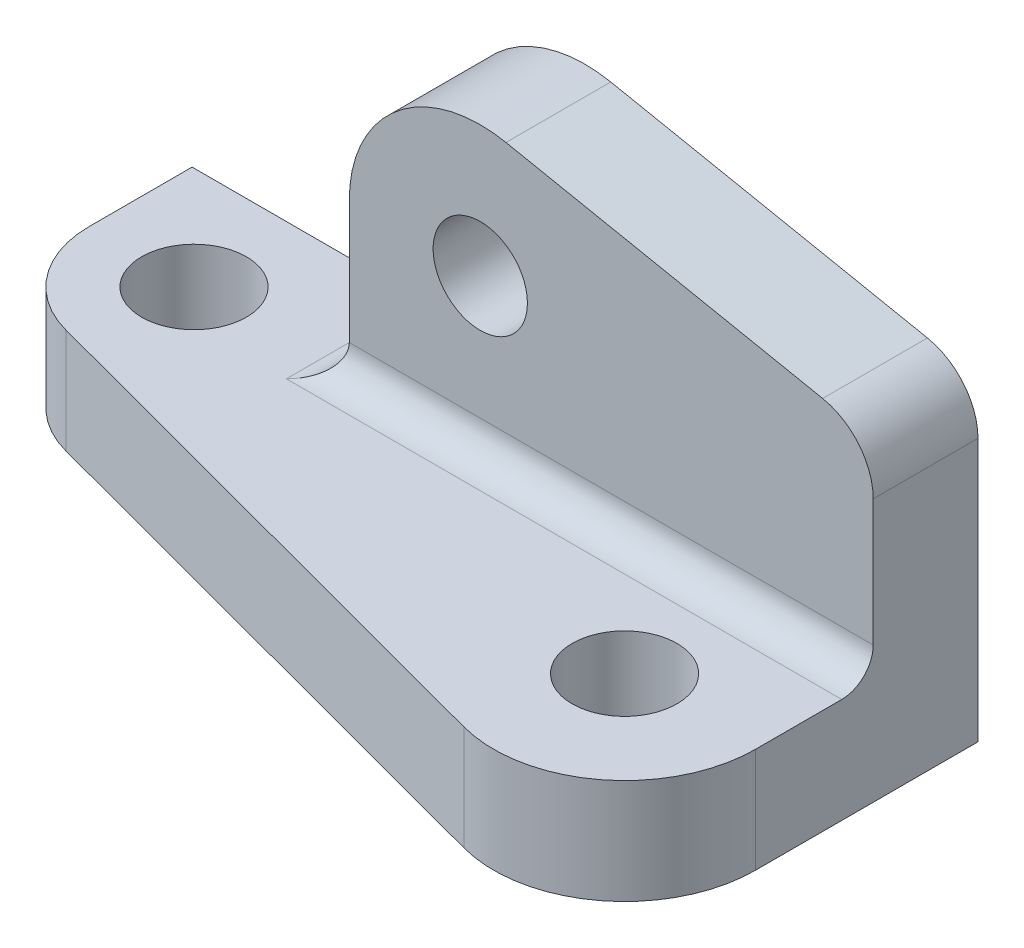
ISO-10303-21;
HEADER;
FILE_DESCRIPTION(('STEP AP214'),'2;1');
FILE_NAME('part.step','',(''),(''),'','','');
FILE_SCHEMA(('AUTOMOTIVE_DESIGN { 1 0 10303 214 1 1 1 1 }'));
ENDSEC;
DATA;
#1=APPLICATION_CONTEXT('core data for automotive mechanical design processes');
#2=APPLICATION_PROTOCOL_DEFINITION('international standard','automotive_design',2000,#1);
#3=PRODUCT_CONTEXT('',#1,'mechanical');
#4=PRODUCT('Part','Part','',(#3));
#5=PRODUCT_RELATED_PRODUCT_CATEGORY('part','',(#4));
#6=PRODUCT_DEFINITION_FORMATION('','',#4);
#7=PRODUCT_DEFINITION_CONTEXT('part definition',#1,'design');
#8=PRODUCT_DEFINITION('design','',#6,#7);
#9=PRODUCT_DEFINITION_SHAPE('','',#8);
#10=(LENGTH_UNIT() NAMED_UNIT(*) SI_UNIT(.MILLI.,.METRE.));
#11=(NAMED_UNIT(*) PLANE_ANGLE_UNIT() SI_UNIT($,.RADIAN.));
#12=(NAMED_UNIT(*) SI_UNIT($,.STERADIAN.) SOLID_ANGLE_UNIT());
#13=UNCERTAINTY_MEASURE_WITH_UNIT(LENGTH_MEASURE(1.E-05),#10,'distance_accuracy_value','');
#14=(GEOMETRIC_REPRESENTATION_CONTEXT(3) GLOBAL_UNCERTAINTY_ASSIGNED_CONTEXT((#13)) GLOBAL_UNIT_ASSIGNED_CONTEXT((#10,
#11,#12)) REPRESENTATION_CONTEXT('',''));
#15=CARTESIAN_POINT('',(0.,0.,0.));
#16=DIRECTION('',(0.,0.,1.));
#17=DIRECTION('',(1.,0.,0.));
#18=AXIS2_PLACEMENT_3D('',#15,#16,#17);
#19=CARTESIAN_POINT('',(0.,20.,0.));
#20=DIRECTION('',(1.,0.,0.));
#21=DIRECTION('',(0.,0.,-1.));
#22=AXIS2_PLACEMENT_3D('',#19,#20,#21);
#23=PLANE('',#22);
#24=DIRECTION('',(0.,0.,1.));
#25=VECTOR('',#24,1.);
#26=CARTESIAN_POINT('',(0.,0.,0.));
#27=LINE('',#26,#25);
#28=CARTESIAN_POINT('',(0.,0.,0.));
#29=VERTEX_POINT('',#28);
#30=CARTESIAN_POINT('',(0.,0.,19.63443373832));
#31=VERTEX_POINT('',#30);
#32=EDGE_CURVE('E149',#29,#31,#27,.T.);
#33=ORIENTED_EDGE('',*,*,#32,.T.);
#34=DIRECTION('',(0.,-1.,0.));
#35=VECTOR('',#34,1.);
#36=CARTESIAN_POINT('',(0.,20.,19.63443373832));
#37=LINE('',#36,#35);
#38=CARTESIAN_POINT('',(0.,20.,19.63443373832));
#39=VERTEX_POINT('',#38);
#40=EDGE_CURVE('E185',#31,#39,#37,.F.);
#41=ORIENTED_EDGE('',*,*,#40,.T.);
#42=DIRECTION('',(0.,0.,1.));
#43=VECTOR('',#42,1.);
#44=CARTESIAN_POINT('',(0.,20.,0.));
#45=LINE('',#44,#43);
#46=CARTESIAN_POINT('',(0.,20.,0.));
#47=VERTEX_POINT('',#46);
#48=EDGE_CURVE('E150',#47,#39,#45,.T.);
#49=ORIENTED_EDGE('',*,*,#48,.F.);
#50=DIRECTION('',(0.,-1.,0.));
#51=VECTOR('',#50,1.);
#52=CARTESIAN_POINT('',(0.,20.,0.));
#53=LINE('',#52,#51);
#54=EDGE_CURVE('E132',#47,#29,#53,.T.);
#55=ORIENTED_EDGE('',*,*,#54,.T.);
#56=EDGE_LOOP('',(#33,#41,#49,#55));
#57=FACE_BOUND('',#56,.T.);
#58=ADVANCED_FACE('F28',(#57),#23,.F.);
#59=CARTESIAN_POINT('',(0.,20.,35.));
#60=DIRECTION('',(0.257662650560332,0.,-0.966234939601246));
#61=DIRECTION('',(-0.966234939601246,0.,-0.257662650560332));
#62=AXIS2_PLACEMENT_3D('',#59,#60,#61);
#63=PLANE('',#62);
#64=DIRECTION('',(0.966234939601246,0.,0.257662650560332));
#65=VECTOR('',#64,1.);
#66=CARTESIAN_POINT('',(0.,20.,35.));
#67=LINE('',#66,#65);
#68=CARTESIAN_POINT('',(14.8467469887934,20.,38.9591325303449));
#69=VERTEX_POINT('',#68);
#70=CARTESIAN_POINT('',(118.558433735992,20.,66.6155823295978));
#71=VERTEX_POINT('',#70);
#72=EDGE_CURVE('E153',#69,#71,#67,.T.);
#73=ORIENTED_EDGE('',*,*,#72,.F.);
#74=DIRECTION('',(0.,-1.,0.));
#75=VECTOR('',#74,1.);
#76=CARTESIAN_POINT('',(14.8467469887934,20.,38.9591325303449));
#77=LINE('',#76,#75);
#78=CARTESIAN_POINT('',(14.8467469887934,0.,38.9591325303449));
#79=VERTEX_POINT('',#78);
#80=EDGE_CURVE('E180',#69,#79,#77,.T.);
#81=ORIENTED_EDGE('',*,*,#80,.T.);
#82=DIRECTION('',(0.966234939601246,0.,0.257662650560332));
#83=VECTOR('',#82,1.);
#84=CARTESIAN_POINT('',(0.,0.,35.));
#85=LINE('',#84,#83);
#86=CARTESIAN_POINT('',(118.558433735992,0.,66.6155823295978));
#87=VERTEX_POINT('',#86);
#88=EDGE_CURVE('E143',#79,#87,#85,.T.);
#89=ORIENTED_EDGE('',*,*,#88,.T.);
#90=DIRECTION('',(0.,-1.,0.));
#91=VECTOR('',#90,1.);
#92=CARTESIAN_POINT('',(118.558433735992,20.,66.6155823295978));
#93=LINE('',#92,#91);
#94=EDGE_CURVE('E175',#87,#71,#93,.F.);
#95=ORIENTED_EDGE('',*,*,#94,.T.);
#96=EDGE_LOOP('',(#73,#81,#89,#95));
#97=FACE_BOUND('',#96,.T.);
#98=ADVANCED_FACE('F294',(#97),#63,.F.);
#99=CARTESIAN_POINT('',(150.,20.,0.));
#100=DIRECTION('',(-1.,0.,0.));
#101=DIRECTION('',(0.,0.,1.));
#102=AXIS2_PLACEMENT_3D('',#99,#100,#101);
#103=PLANE('',#102);
#104=DIRECTION('',(0.,-1.,0.));
#105=VECTOR('',#104,1.);
#106=CARTESIAN_POINT('',(150.,20.,0.));
#107=LINE('',#106,#105);
#108=CARTESIAN_POINT('',(150.,50.1623531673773,0.));
#109=VERTEX_POINT('',#108);
#110=CARTESIAN_POINT('',(150.,0.,0.));
#111=VERTEX_POINT('',#110);
#112=EDGE_CURVE('E120',#109,#111,#107,.T.);
#113=ORIENTED_EDGE('',*,*,#112,.F.);
#114=DIRECTION('',(0.,0.,-1.));
#115=VECTOR('',#114,1.);
#116=CARTESIAN_POINT('',(150.,50.1623531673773,20.));
#117=LINE('',#116,#115);
#118=CARTESIAN_POINT('',(150.,50.1623531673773,20.));
#119=VERTEX_POINT('',#118);
#120=EDGE_CURVE('E193',#109,#119,#117,.F.);
#121=ORIENTED_EDGE('',*,*,#120,.T.);
#122=DIRECTION('',(0.,-1.,0.));
#123=VECTOR('',#122,1.);
#124=CARTESIAN_POINT('',(150.,0.,20.));
#125=LINE('',#124,#123);
#126=CARTESIAN_POINT('',(150.,26.,20.));
#127=VERTEX_POINT('',#126);
#128=EDGE_CURVE('E223',#119,#127,#125,.T.);
#129=ORIENTED_EDGE('',*,*,#128,.T.);
#130=CARTESIAN_POINT('',(150.,26.,26.));
#131=DIRECTION('',(-1.,0.,0.));
#132=DIRECTION('',(0.,0.,1.));
#133=AXIS2_PLACEMENT_3D('',#130,#131,#132);
#134=CIRCLE('',#133,6.);
#135=CARTESIAN_POINT('',(150.,20.,26.));
#136=VERTEX_POINT('',#135);
#137=EDGE_CURVE('E11',#127,#136,#134,.T.);
#138=ORIENTED_EDGE('',*,*,#137,.T.);
#139=DIRECTION('',(0.,0.,-1.));
#140=VECTOR('',#139,1.);
#141=CARTESIAN_POINT('',(150.,20.,0.));
#142=LINE('',#141,#140);
#143=CARTESIAN_POINT('',(150.,20.,42.4597088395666));
#144=VERTEX_POINT('',#143);
#145=EDGE_CURVE('E158',#144,#136,#142,.T.);
#146=ORIENTED_EDGE('',*,*,#145,.F.);
#147=DIRECTION('',(0.,-1.,0.));
#148=VECTOR('',#147,1.);
#149=CARTESIAN_POINT('',(150.,20.,42.4597088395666));
#150=LINE('',#149,#148);
#151=CARTESIAN_POINT('',(150.,0.,42.4597088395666));
#152=VERTEX_POINT('',#151);
#153=EDGE_CURVE('E140',#144,#152,#150,.T.);
#154=ORIENTED_EDGE('',*,*,#153,.T.);
#155=DIRECTION('',(0.,0.,-1.));
#156=VECTOR('',#155,1.);
#157=CARTESIAN_POINT('',(150.,0.,0.));
#158=LINE('',#157,#156);
#159=EDGE_CURVE('E136',#152,#111,#158,.T.);
#160=ORIENTED_EDGE('',*,*,#159,.T.);
#161=EDGE_LOOP('',(#113,#121,#129,#138,#146,#154,#160));
#162=FACE_BOUND('',#161,.T.);
#163=ADVANCED_FACE('F137',(#162),#103,.F.);
#164=CARTESIAN_POINT('',(0.,20.,0.));
#165=DIRECTION('',(0.,0.,1.));
#166=DIRECTION('',(1.,0.,0.));
#167=AXIS2_PLACEMENT_3D('',#164,#165,#166);
#168=PLANE('',#167);
#169=CARTESIAN_POINT('',(75.,49.5049024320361,0.));
#170=DIRECTION('',(0.,0.,1.));
#171=DIRECTION('',(1.,0.,0.));
#172=AXIS2_PLACEMENT_3D('',#169,#170,#171);
#173=CIRCLE('',#172,8.99999999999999);
#174=CARTESIAN_POINT('',(84.,49.5049024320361,0.));
#175=VERTEX_POINT('',#174);
#176=EDGE_CURVE('E254',#175,#175,#173,.T.);
#177=ORIENTED_EDGE('',*,*,#176,.T.);
#178=EDGE_LOOP('',(#177));
#179=FACE_BOUND('',#178,.T.);
#180=DIRECTION('',(0.98058067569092,-0.196116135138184,0.));
#181=VECTOR('',#180,1.);
#182=CARTESIAN_POINT('',(150.,60.,0.));
#183=LINE('',#182,#181);
#184=CARTESIAN_POINT('',(79.9029033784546,74.0194193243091,0.));
#185=VERTEX_POINT('',#184);
#186=CARTESIAN_POINT('',(140.353393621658,61.9293212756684,0.));
#187=VERTEX_POINT('',#186);
#188=EDGE_CURVE('E213',#185,#187,#183,.T.);
#189=ORIENTED_EDGE('',*,*,#188,.T.);
#190=CARTESIAN_POINT('',(138.,50.1623531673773,0.));
#191=DIRECTION('',(0.,0.,1.));
#192=DIRECTION('',(1.,0.,0.));
#193=AXIS2_PLACEMENT_3D('',#190,#191,#192);
#194=CIRCLE('',#193,12.);
#195=EDGE_CURVE('E128',#187,#109,#194,.F.);
#196=ORIENTED_EDGE('',*,*,#195,.T.);
#197=ORIENTED_EDGE('',*,*,#112,.T.);
#198=DIRECTION('',(-1.,0.,0.));
#199=VECTOR('',#198,1.);
#200=CARTESIAN_POINT('',(0.,0.,0.));
#201=LINE('',#200,#199);
#202=EDGE_CURVE('E126',#111,#29,#201,.T.);
#203=ORIENTED_EDGE('',*,*,#202,.T.);
#204=ORIENTED_EDGE('',*,*,#54,.F.);
#205=DIRECTION('',(-1.,0.,0.));
#206=VECTOR('',#205,1.);
#207=CARTESIAN_POINT('',(0.,20.,0.));
#208=LINE('',#207,#206);
#209=CARTESIAN_POINT('',(44.,20.,0.));
#210=VERTEX_POINT('',#209);
#211=EDGE_CURVE('E160',#210,#47,#208,.T.);
#212=ORIENTED_EDGE('',*,*,#211,.F.);
#213=CARTESIAN_POINT('',(44.,26.,0.));
#214=DIRECTION('',(0.,0.,1.));
#215=DIRECTION('',(1.,0.,0.));
#216=AXIS2_PLACEMENT_3D('',#213,#214,#215);
#217=CIRCLE('',#216,6.);
#218=CARTESIAN_POINT('',(50.,26.,0.));
#219=VERTEX_POINT('',#218);
#220=EDGE_CURVE('E35',#210,#219,#217,.T.);
#221=ORIENTED_EDGE('',*,*,#220,.T.);
#222=DIRECTION('',(0.,1.,0.));
#223=VECTOR('',#222,1.);
#224=CARTESIAN_POINT('',(50.,0.,0.));
#225=LINE('',#224,#223);
#226=CARTESIAN_POINT('',(50.,49.5049024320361,0.));
#227=VERTEX_POINT('',#226);
#228=EDGE_CURVE('E206',#219,#227,#225,.T.);
#229=ORIENTED_EDGE('',*,*,#228,.T.);
#230=CARTESIAN_POINT('',(75.,49.5049024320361,0.));
#231=DIRECTION('',(0.,0.,1.));
#232=DIRECTION('',(1.,0.,0.));
#233=AXIS2_PLACEMENT_3D('',#230,#231,#232);
#234=CIRCLE('',#233,25.);
#235=EDGE_CURVE('E165',#227,#185,#234,.F.);
#236=ORIENTED_EDGE('',*,*,#235,.T.);
#237=EDGE_LOOP('',(#189,#196,#197,#203,#204,#212,#221,#229,#236));
#238=FACE_BOUND('',#237,.T.);
#239=ADVANCED_FACE('F123',(#179,#238),#168,.F.);
#240=CARTESIAN_POINT('',(0.,20.,0.));
#241=DIRECTION('',(0.,1.,0.));
#242=DIRECTION('',(0.,0.,1.));
#243=AXIS2_PLACEMENT_3D('',#240,#241,#242);
#244=PLANE('',#243);
#245=CARTESIAN_POINT('',(125.,20.,42.4597088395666));
#246=DIRECTION('',(0.,1.,0.));
#247=DIRECTION('',(0.,0.,1.));
#248=AXIS2_PLACEMENT_3D('',#245,#246,#247);
#249=CIRCLE('',#248,9.99999999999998);
#250=CARTESIAN_POINT('',(125.,20.,52.4597088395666));
#251=VERTEX_POINT('',#250);
#252=EDGE_CURVE('E248',#251,#251,#249,.T.);
#253=ORIENTED_EDGE('',*,*,#252,.F.);
#254=EDGE_LOOP('',(#253));
#255=FACE_BOUND('',#254,.T.);
#256=CARTESIAN_POINT('',(20.,20.,19.63443373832));
#257=DIRECTION('',(0.,1.,0.));
#258=DIRECTION('',(0.,0.,1.));
#259=AXIS2_PLACEMENT_3D('',#256,#257,#258);
#260=CIRCLE('',#259,9.99999999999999);
#261=CARTESIAN_POINT('',(20.,20.,29.63443373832));
#262=VERTEX_POINT('',#261);
#263=EDGE_CURVE('E242',#262,#262,#260,.T.);
#264=ORIENTED_EDGE('',*,*,#263,.F.);
#265=EDGE_LOOP('',(#264));
#266=FACE_BOUND('',#265,.T.);
#267=DIRECTION('',(1.,0.,0.));
#268=VECTOR('',#267,1.);
#269=CARTESIAN_POINT('',(50.,20.,26.));
#270=LINE('',#269,#268);
#271=CARTESIAN_POINT('',(44.,20.,26.));
#272=VERTEX_POINT('',#271);
#273=EDGE_CURVE('E50',#136,#272,#270,.F.);
#274=ORIENTED_EDGE('',*,*,#273,.T.);
#275=DIRECTION('',(0.,0.,1.));
#276=VECTOR('',#275,1.);
#277=CARTESIAN_POINT('',(44.,20.,0.));
#278=LINE('',#277,#276);
#279=EDGE_CURVE('E201',#272,#210,#278,.F.);
#280=ORIENTED_EDGE('',*,*,#279,.T.);
#281=ORIENTED_EDGE('',*,*,#211,.T.);
#282=ORIENTED_EDGE('',*,*,#48,.T.);
#283=CARTESIAN_POINT('',(20.,20.,19.63443373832));
#284=DIRECTION('',(0.,1.,0.));
#285=DIRECTION('',(0.,0.,1.));
#286=AXIS2_PLACEMENT_3D('',#283,#284,#285);
#287=CIRCLE('',#286,20.);
#288=EDGE_CURVE('E187',#39,#69,#287,.T.);
#289=ORIENTED_EDGE('',*,*,#288,.T.);
#290=ORIENTED_EDGE('',*,*,#72,.T.);
#291=CARTESIAN_POINT('',(125.,20.,42.4597088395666));
#292=DIRECTION('',(0.,1.,0.));
#293=DIRECTION('',(0.,0.,1.));
#294=AXIS2_PLACEMENT_3D('',#291,#292,#293);
#295=CIRCLE('',#294,25.);
#296=EDGE_CURVE('E178',#71,#144,#295,.T.);
#297=ORIENTED_EDGE('',*,*,#296,.T.);
#298=ORIENTED_EDGE('',*,*,#145,.T.);
#299=EDGE_LOOP('',(#274,#280,#281,#282,#289,#290,#297,#298));
#300=FACE_BOUND('',#299,.T.);
#301=ADVANCED_FACE('F224',(#255,#266,#300),#244,.T.);
#302=CARTESIAN_POINT('',(0.,0.,0.));
#303=DIRECTION('',(0.,1.,0.));
#304=DIRECTION('',(0.,0.,1.));
#305=AXIS2_PLACEMENT_3D('',#302,#303,#304);
#306=PLANE('',#305);
#307=CARTESIAN_POINT('',(125.,0.,42.4597088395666));
#308=DIRECTION('',(0.,1.,0.));
#309=DIRECTION('',(0.,0.,1.));
#310=AXIS2_PLACEMENT_3D('',#307,#308,#309);
#311=CIRCLE('',#310,10.);
#312=CARTESIAN_POINT('',(125.,0.,52.4597088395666));
#313=VERTEX_POINT('',#312);
#314=EDGE_CURVE('E245',#313,#313,#311,.T.);
#315=ORIENTED_EDGE('',*,*,#314,.T.);
#316=EDGE_LOOP('',(#315));
#317=FACE_BOUND('',#316,.T.);
#318=CARTESIAN_POINT('',(20.,0.,19.63443373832));
#319=DIRECTION('',(0.,1.,0.));
#320=DIRECTION('',(0.,0.,1.));
#321=AXIS2_PLACEMENT_3D('',#318,#319,#320);
#322=CIRCLE('',#321,9.99999999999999);
#323=CARTESIAN_POINT('',(20.,0.,29.63443373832));
#324=VERTEX_POINT('',#323);
#325=EDGE_CURVE('E219',#324,#324,#322,.T.);
#326=ORIENTED_EDGE('',*,*,#325,.T.);
#327=EDGE_LOOP('',(#326));
#328=FACE_BOUND('',#327,.T.);
#329=ORIENTED_EDGE('',*,*,#88,.F.);
#330=CARTESIAN_POINT('',(20.,0.,19.63443373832));
#331=DIRECTION('',(0.,1.,0.));
#332=DIRECTION('',(0.,0.,1.));
#333=AXIS2_PLACEMENT_3D('',#330,#331,#332);
#334=CIRCLE('',#333,20.);
#335=EDGE_CURVE('E183',#79,#31,#334,.F.);
#336=ORIENTED_EDGE('',*,*,#335,.T.);
#337=ORIENTED_EDGE('',*,*,#32,.F.);
#338=ORIENTED_EDGE('',*,*,#202,.F.);
#339=ORIENTED_EDGE('',*,*,#159,.F.);
#340=CARTESIAN_POINT('',(125.,0.,42.4597088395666));
#341=DIRECTION('',(0.,1.,0.));
#342=DIRECTION('',(0.,0.,1.));
#343=AXIS2_PLACEMENT_3D('',#340,#341,#342);
#344=CIRCLE('',#343,25.);
#345=EDGE_CURVE('E173',#152,#87,#344,.F.);
#346=ORIENTED_EDGE('',*,*,#345,.T.);
#347=EDGE_LOOP('',(#329,#336,#337,#338,#339,#346));
#348=FACE_BOUND('',#347,.T.);
#349=ADVANCED_FACE('F147',(#317,#328,#348),#306,.F.);
#350=CARTESIAN_POINT('',(150.,60.,20.));
#351=DIRECTION('',(0.196116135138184,0.98058067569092,0.));
#352=DIRECTION('',(-0.98058067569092,0.196116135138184,0.));
#353=AXIS2_PLACEMENT_3D('',#350,#351,#352);
#354=PLANE('',#353);
#355=DIRECTION('',(0.98058067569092,-0.196116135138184,0.));
#356=VECTOR('',#355,1.);
#357=CARTESIAN_POINT('',(150.,60.,20.));
#358=LINE('',#357,#356);
#359=CARTESIAN_POINT('',(79.9029033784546,74.0194193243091,20.));
#360=VERTEX_POINT('',#359);
#361=CARTESIAN_POINT('',(140.353393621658,61.9293212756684,20.));
#362=VERTEX_POINT('',#361);
#363=EDGE_CURVE('E231',#360,#362,#358,.T.);
#364=ORIENTED_EDGE('',*,*,#363,.T.);
#365=DIRECTION('',(0.,0.,-1.));
#366=VECTOR('',#365,1.);
#367=CARTESIAN_POINT('',(140.353393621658,61.9293212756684,0.));
#368=LINE('',#367,#366);
#369=EDGE_CURVE('E189',#362,#187,#368,.T.);
#370=ORIENTED_EDGE('',*,*,#369,.T.);
#371=ORIENTED_EDGE('',*,*,#188,.F.);
#372=DIRECTION('',(0.,0.,-1.));
#373=VECTOR('',#372,1.);
#374=CARTESIAN_POINT('',(79.9029033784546,74.0194193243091,20.));
#375=LINE('',#374,#373);
#376=EDGE_CURVE('E167',#185,#360,#375,.F.);
#377=ORIENTED_EDGE('',*,*,#376,.T.);
#378=EDGE_LOOP('',(#364,#370,#371,#377));
#379=FACE_BOUND('',#378,.T.);
#380=ADVANCED_FACE('F276',(#379),#354,.T.);
#381=CARTESIAN_POINT('',(50.,0.,20.));
#382=DIRECTION('',(-1.,0.,0.));
#383=DIRECTION('',(0.,0.,1.));
#384=AXIS2_PLACEMENT_3D('',#381,#382,#383);
#385=PLANE('',#384);
#386=ORIENTED_EDGE('',*,*,#228,.F.);
#387=DIRECTION('',(0.,0.,1.));
#388=VECTOR('',#387,1.);
#389=CARTESIAN_POINT('',(50.,26.,20.));
#390=LINE('',#389,#388);
#391=CARTESIAN_POINT('',(50.,26.,20.));
#392=VERTEX_POINT('',#391);
#393=EDGE_CURVE('E197',#219,#392,#390,.T.);
#394=ORIENTED_EDGE('',*,*,#393,.T.);
#395=DIRECTION('',(0.,1.,0.));
#396=VECTOR('',#395,1.);
#397=CARTESIAN_POINT('',(50.,0.,20.));
#398=LINE('',#397,#396);
#399=CARTESIAN_POINT('',(50.,49.5049024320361,20.));
#400=VERTEX_POINT('',#399);
#401=EDGE_CURVE('E236',#392,#400,#398,.T.);
#402=ORIENTED_EDGE('',*,*,#401,.T.);
#403=DIRECTION('',(0.,0.,-1.));
#404=VECTOR('',#403,1.);
#405=CARTESIAN_POINT('',(50.,49.5049024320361,20.));
#406=LINE('',#405,#404);
#407=EDGE_CURVE('E131',#400,#227,#406,.T.);
#408=ORIENTED_EDGE('',*,*,#407,.T.);
#409=EDGE_LOOP('',(#386,#394,#402,#408));
#410=FACE_BOUND('',#409,.T.);
#411=ADVANCED_FACE('F211',(#410),#385,.T.);
#412=CARTESIAN_POINT('',(150.,0.,20.));
#413=DIRECTION('',(0.,0.,1.));
#414=DIRECTION('',(1.,0.,0.));
#415=AXIS2_PLACEMENT_3D('',#412,#413,#414);
#416=PLANE('',#415);
#417=CARTESIAN_POINT('',(75.,49.5049024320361,19.999999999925));
#418=DIRECTION('',(0.,0.,1.));
#419=DIRECTION('',(1.,0.,0.));
#420=AXIS2_PLACEMENT_3D('',#417,#418,#419);
#421=CIRCLE('',#420,8.99999999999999);
#422=CARTESIAN_POINT('',(84.,49.5049024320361,19.999999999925));
#423=VERTEX_POINT('',#422);
#424=EDGE_CURVE('E251',#423,#423,#421,.T.);
#425=ORIENTED_EDGE('',*,*,#424,.F.);
#426=EDGE_LOOP('',(#425));
#427=FACE_BOUND('',#426,.T.);
#428=ORIENTED_EDGE('',*,*,#401,.F.);
#429=DIRECTION('',(1.,0.,0.));
#430=VECTOR('',#429,1.);
#431=CARTESIAN_POINT('',(150.,26.,20.));
#432=LINE('',#431,#430);
#433=EDGE_CURVE('E42',#392,#127,#432,.T.);
#434=ORIENTED_EDGE('',*,*,#433,.T.);
#435=ORIENTED_EDGE('',*,*,#128,.F.);
#436=CARTESIAN_POINT('',(138.,50.1623531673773,20.));
#437=DIRECTION('',(0.,0.,1.));
#438=DIRECTION('',(1.,0.,0.));
#439=AXIS2_PLACEMENT_3D('',#436,#437,#438);
#440=CIRCLE('',#439,12.);
#441=EDGE_CURVE('E195',#119,#362,#440,.T.);
#442=ORIENTED_EDGE('',*,*,#441,.T.);
#443=ORIENTED_EDGE('',*,*,#363,.F.);
#444=CARTESIAN_POINT('',(75.,49.5049024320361,20.));
#445=DIRECTION('',(0.,0.,1.));
#446=DIRECTION('',(1.,0.,0.));
#447=AXIS2_PLACEMENT_3D('',#444,#445,#446);
#448=CIRCLE('',#447,25.);
#449=EDGE_CURVE('E169',#360,#400,#448,.T.);
#450=ORIENTED_EDGE('',*,*,#449,.T.);
#451=EDGE_LOOP('',(#428,#434,#435,#442,#443,#450));
#452=FACE_BOUND('',#451,.T.);
#453=ADVANCED_FACE('F266',(#427,#452),#416,.T.);
#454=CARTESIAN_POINT('',(75.,49.5049024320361,20.));
#455=DIRECTION('',(0.,0.,-1.));
#456=DIRECTION('',(-1.,0.,0.));
#457=AXIS2_PLACEMENT_3D('',#454,#455,#456);
#458=CYLINDRICAL_SURFACE('',#457,25.);
#459=ORIENTED_EDGE('',*,*,#449,.F.);
#460=ORIENTED_EDGE('',*,*,#376,.F.);
#461=ORIENTED_EDGE('',*,*,#235,.F.);
#462=ORIENTED_EDGE('',*,*,#407,.F.);
#463=EDGE_LOOP('',(#459,#460,#461,#462));
#464=FACE_BOUND('',#463,.T.);
#465=ADVANCED_FACE('F268',(#464),#458,.T.);
#466=CARTESIAN_POINT('',(125.,20.,42.4597088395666));
#467=DIRECTION('',(0.,-1.,0.));
#468=DIRECTION('',(0.,0.,-1.));
#469=AXIS2_PLACEMENT_3D('',#466,#467,#468);
#470=CYLINDRICAL_SURFACE('',#469,25.);
#471=ORIENTED_EDGE('',*,*,#296,.F.);
#472=ORIENTED_EDGE('',*,*,#94,.F.);
#473=ORIENTED_EDGE('',*,*,#345,.F.);
#474=ORIENTED_EDGE('',*,*,#153,.F.);
#475=EDGE_LOOP('',(#471,#472,#473,#474));
#476=FACE_BOUND('',#475,.T.);
#477=ADVANCED_FACE('F229',(#476),#470,.T.);
#478=CARTESIAN_POINT('',(20.,20.,19.63443373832));
#479=DIRECTION('',(0.,-1.,0.));
#480=DIRECTION('',(0.,0.,-1.));
#481=AXIS2_PLACEMENT_3D('',#478,#479,#480);
#482=CYLINDRICAL_SURFACE('',#481,20.);
#483=ORIENTED_EDGE('',*,*,#288,.F.);
#484=ORIENTED_EDGE('',*,*,#40,.F.);
#485=ORIENTED_EDGE('',*,*,#335,.F.);
#486=ORIENTED_EDGE('',*,*,#80,.F.);
#487=EDGE_LOOP('',(#483,#484,#485,#486));
#488=FACE_BOUND('',#487,.T.);
#489=ADVANCED_FACE('F282',(#488),#482,.T.);
#490=CARTESIAN_POINT('',(138.,50.1623531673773,20.));
#491=DIRECTION('',(0.,0.,1.));
#492=DIRECTION('',(1.,0.,0.));
#493=AXIS2_PLACEMENT_3D('',#490,#491,#492);
#494=CYLINDRICAL_SURFACE('',#493,12.);
#495=ORIENTED_EDGE('',*,*,#441,.F.);
#496=ORIENTED_EDGE('',*,*,#120,.F.);
#497=ORIENTED_EDGE('',*,*,#195,.F.);
#498=ORIENTED_EDGE('',*,*,#369,.F.);
#499=EDGE_LOOP('',(#495,#496,#497,#498));
#500=FACE_BOUND('',#499,.T.);
#501=ADVANCED_FACE('F280',(#500),#494,.T.);
#502=CARTESIAN_POINT('',(150.,26.,26.));
#503=DIRECTION('',(-1.,0.,0.));
#504=DIRECTION('',(0.,0.,1.));
#505=AXIS2_PLACEMENT_3D('',#502,#503,#504);
#506=CYLINDRICAL_SURFACE('',#505,6.);
#507=ORIENTED_EDGE('',*,*,#137,.F.);
#508=ORIENTED_EDGE('',*,*,#433,.F.);
#509=CARTESIAN_POINT('',(44.,26.,26.));
#510=DIRECTION('',(-0.707106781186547,0.,-0.707106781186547));
#511=DIRECTION('',(-0.707106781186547,0.,0.707106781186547));
#512=AXIS2_PLACEMENT_3D('',#509,#510,#511);
#513=ELLIPSE('',#512,8.48528137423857,6.);
#514=EDGE_CURVE('E214',#272,#392,#513,.F.);
#515=ORIENTED_EDGE('',*,*,#514,.F.);
#516=ORIENTED_EDGE('',*,*,#273,.F.);
#517=EDGE_LOOP('',(#507,#508,#515,#516));
#518=FACE_BOUND('',#517,.T.);
#519=ADVANCED_FACE('F222',(#518),#506,.F.);
#520=CARTESIAN_POINT('',(44.,26.,20.));
#521=DIRECTION('',(0.,0.,-1.));
#522=DIRECTION('',(-1.,0.,0.));
#523=AXIS2_PLACEMENT_3D('',#520,#521,#522);
#524=CYLINDRICAL_SURFACE('',#523,6.);
#525=ORIENTED_EDGE('',*,*,#220,.F.);
#526=ORIENTED_EDGE('',*,*,#279,.F.);
#527=ORIENTED_EDGE('',*,*,#514,.T.);
#528=ORIENTED_EDGE('',*,*,#393,.F.);
#529=EDGE_LOOP('',(#525,#526,#527,#528));
#530=FACE_BOUND('',#529,.T.);
#531=ADVANCED_FACE('F216',(#530),#524,.F.);
#532=CARTESIAN_POINT('',(20.,20.,19.63443373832));
#533=DIRECTION('',(0.,1.,0.));
#534=DIRECTION('',(0.,0.,1.));
#535=AXIS2_PLACEMENT_3D('',#532,#533,#534);
#536=CYLINDRICAL_SURFACE('',#535,9.99999999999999);
#537=ORIENTED_EDGE('',*,*,#325,.F.);
#538=EDGE_LOOP('',(#537));
#539=FACE_BOUND('',#538,.T.);
#540=ORIENTED_EDGE('',*,*,#263,.T.);
#541=EDGE_LOOP('',(#540));
#542=FACE_BOUND('',#541,.T.);
#543=ADVANCED_FACE('F369',(#539,#542),#536,.F.);
#544=CARTESIAN_POINT('',(125.,20.,42.4597088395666));
#545=DIRECTION('',(0.,1.,0.));
#546=DIRECTION('',(0.,0.,1.));
#547=AXIS2_PLACEMENT_3D('',#544,#545,#546);
#548=CYLINDRICAL_SURFACE('',#547,9.99999999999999);
#549=ORIENTED_EDGE('',*,*,#314,.F.);
#550=EDGE_LOOP('',(#549));
#551=FACE_BOUND('',#550,.T.);
#552=ORIENTED_EDGE('',*,*,#252,.T.);
#553=EDGE_LOOP('',(#552));
#554=FACE_BOUND('',#553,.T.);
#555=ADVANCED_FACE('F262',(#551,#554),#548,.F.);
#556=CARTESIAN_POINT('',(75.,49.5049024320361,19.999999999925));
#557=DIRECTION('',(0.,0.,1.));
#558=DIRECTION('',(1.,0.,0.));
#559=AXIS2_PLACEMENT_3D('',#556,#557,#558);
#560=CYLINDRICAL_SURFACE('',#559,8.99999999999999);
#561=ORIENTED_EDGE('',*,*,#176,.F.);
#562=EDGE_LOOP('',(#561));
#563=FACE_BOUND('',#562,.T.);
#564=ORIENTED_EDGE('',*,*,#424,.T.);
#565=EDGE_LOOP('',(#564));
#566=FACE_BOUND('',#565,.T.);
#567=ADVANCED_FACE('F259',(#563,#566),#560,.F.);
#568=CLOSED_SHELL('',(#58,#98,#163,#239,#301,#349,#380,#411,#453,#465,#477,#489,#501,#519,#531,
#543,#555,#567));
#569=MANIFOLD_SOLID_BREP('B2',#568);
#570=ADVANCED_BREP_SHAPE_REPRESENTATION('',(#18,#569),#14);
#571=SHAPE_DEFINITION_REPRESENTATION(#9,#570);
ENDSEC;
END-ISO-10303-21;
